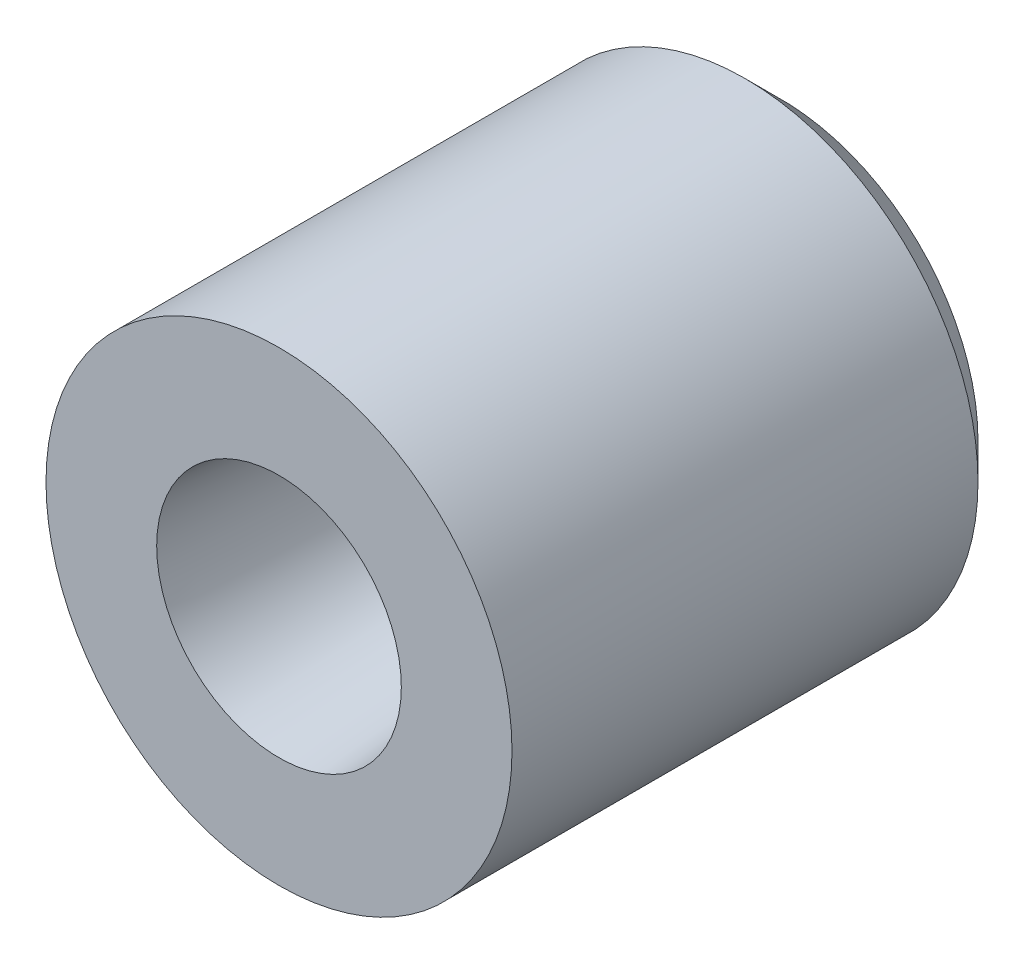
ISO-10303-21;
HEADER;
FILE_DESCRIPTION(('STEP AP214'),'2;1');
FILE_NAME('part.step','',(''),(''),'','','');
FILE_SCHEMA(('AUTOMOTIVE_DESIGN { 1 0 10303 214 1 1 1 1 }'));
ENDSEC;
DATA;
#1=APPLICATION_CONTEXT('core data for automotive mechanical design processes');
#2=APPLICATION_PROTOCOL_DEFINITION('international standard','automotive_design',2000,#1);
#3=PRODUCT_CONTEXT('',#1,'mechanical');
#4=PRODUCT('Part','Part','',(#3));
#5=PRODUCT_RELATED_PRODUCT_CATEGORY('part','',(#4));
#6=PRODUCT_DEFINITION_FORMATION('','',#4);
#7=PRODUCT_DEFINITION_CONTEXT('part definition',#1,'design');
#8=PRODUCT_DEFINITION('design','',#6,#7);
#9=PRODUCT_DEFINITION_SHAPE('','',#8);
#10=(LENGTH_UNIT() NAMED_UNIT(*) SI_UNIT(.MILLI.,.METRE.));
#11=(NAMED_UNIT(*) PLANE_ANGLE_UNIT() SI_UNIT($,.RADIAN.));
#12=(NAMED_UNIT(*) SI_UNIT($,.STERADIAN.) SOLID_ANGLE_UNIT());
#13=UNCERTAINTY_MEASURE_WITH_UNIT(LENGTH_MEASURE(1.E-05),#10,'distance_accuracy_value','');
#14=(GEOMETRIC_REPRESENTATION_CONTEXT(3) GLOBAL_UNCERTAINTY_ASSIGNED_CONTEXT((#13)) GLOBAL_UNIT_ASSIGNED_CONTEXT((#10,
#11,#12)) REPRESENTATION_CONTEXT('',''));
#15=CARTESIAN_POINT('',(0.,0.,0.));
#16=DIRECTION('',(0.,0.,1.));
#17=DIRECTION('',(1.,0.,0.));
#18=AXIS2_PLACEMENT_3D('',#15,#16,#17);
#19=CARTESIAN_POINT('',(0.,0.,-6.76768647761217));
#20=DIRECTION('',(0.,0.,1.));
#21=DIRECTION('',(1.,0.,0.));
#22=AXIS2_PLACEMENT_3D('',#19,#20,#21);
#23=CONICAL_SURFACE('',#22,4.20738154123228,0.785398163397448);
#24=CARTESIAN_POINT('',(0.,0.,-9.32506801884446));
#25=DIRECTION('',(0.,0.,1.));
#26=DIRECTION('',(1.,0.,0.));
#27=AXIS2_PLACEMENT_3D('',#24,#25,#26);
#28=CIRCLE('',#27,1.64999999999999);
#29=CARTESIAN_POINT('',(1.64999999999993,0.,-9.32506801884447));
#30=VERTEX_POINT('',#29);
#31=EDGE_CURVE('E97',#30,#30,#28,.F.);
#32=ORIENTED_EDGE('',*,*,#31,.T.);
#33=EDGE_LOOP('',(#32));
#34=FACE_BOUND('',#33,.T.);
#35=CARTESIAN_POINT('',(1.99999887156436,0.,-8.97506914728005));
#36=CARTESIAN_POINT('',(2.97506712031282,0.,-8.0000008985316));
#37=B_SPLINE_CURVE_WITH_KNOTS('',1,(#35,#36),.UNSPECIFIED.,.F.,.F.,(2,2),(0.47535476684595,
0.707106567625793),.UNSPECIFIED.);
#38=CARTESIAN_POINT('',(1.99999999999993,0.,-8.97506801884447));
#39=VERTEX_POINT('',#38);
#40=CARTESIAN_POINT('',(2.9750680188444,0.,-8.));
#41=VERTEX_POINT('',#40);
#42=EDGE_CURVE('E44',#39,#41,#37,.T.);
#43=ORIENTED_EDGE('',*,*,#42,.F.);
#44=ORIENTED_EDGE('',*,*,#42,.T.);
#45=CARTESIAN_POINT('',(0.,0.,-8.));
#46=DIRECTION('',(0.,0.,-1.));
#47=DIRECTION('',(-1.,0.,0.));
#48=AXIS2_PLACEMENT_3D('',#45,#46,#47);
#49=CIRCLE('',#48,2.97506801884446);
#50=CARTESIAN_POINT('',(-2.97506801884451,0.,-8.));
#51=VERTEX_POINT('',#50);
#52=EDGE_CURVE('E11',#51,#41,#49,.T.);
#53=ORIENTED_EDGE('',*,*,#52,.F.);
#54=CARTESIAN_POINT('',(0.,0.,-8.));
#55=DIRECTION('',(0.,0.,-1.));
#56=DIRECTION('',(-1.,0.,0.));
#57=AXIS2_PLACEMENT_3D('',#54,#55,#56);
#58=CIRCLE('',#57,2.97506801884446);
#59=EDGE_CURVE('E55',#41,#51,#58,.T.);
#60=ORIENTED_EDGE('',*,*,#59,.F.);
#61=EDGE_LOOP('',(#43,#44,#53,#60));
#62=FACE_BOUND('',#61,.T.);
#63=ADVANCED_FACE('F36',(#34,#62),#23,.F.);
#64=CARTESIAN_POINT('',(0.,0.,-7.5));
#65=DIRECTION('',(0.,0.,-1.));
#66=DIRECTION('',(-1.,0.,0.));
#67=AXIS2_PLACEMENT_3D('',#64,#65,#66);
#68=CYLINDRICAL_SURFACE('',#67,2.97506801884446);
#69=CARTESIAN_POINT('',(0.,0.,-6.));
#70=DIRECTION('',(0.,0.,-1.));
#71=DIRECTION('',(-1.,0.,0.));
#72=AXIS2_PLACEMENT_3D('',#69,#70,#71);
#73=CIRCLE('',#72,2.97506801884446);
#74=CARTESIAN_POINT('',(-2.9750680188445,0.,-6.));
#75=VERTEX_POINT('',#74);
#76=EDGE_CURVE('E145',#75,#75,#73,.T.);
#77=ORIENTED_EDGE('',*,*,#76,.F.);
#78=CARTESIAN_POINT('',(-2.9750680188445,0.,-5.99999694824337));
#79=CARTESIAN_POINT('',(-2.97506801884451,0.,-8.000002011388));
#80=B_SPLINE_CURVE_WITH_KNOTS('',1,(#78,#79),.UNSPECIFIED.,.F.,.F.,(2,2),(0.0833320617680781,
0.91666750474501),.UNSPECIFIED.);
#81=EDGE_CURVE('E140',#75,#51,#80,.T.);
#82=ORIENTED_EDGE('',*,*,#81,.T.);
#83=ORIENTED_EDGE('',*,*,#52,.T.);
#84=ORIENTED_EDGE('',*,*,#59,.T.);
#85=ORIENTED_EDGE('',*,*,#81,.F.);
#86=EDGE_LOOP('',(#77,#82,#83,#84,#85));
#87=FACE_BOUND('',#86,.T.);
#88=ADVANCED_FACE('F177',(#87),#68,.F.);
#89=CARTESIAN_POINT('',(0.,0.,-1.));
#90=DIRECTION('',(0.,0.,1.));
#91=DIRECTION('',(-1.,0.,0.));
#92=AXIS2_PLACEMENT_3D('',#89,#90,#91);
#93=CONICAL_SURFACE('',#92,3.41251133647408,0.0872664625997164);
#94=ORIENTED_EDGE('',*,*,#76,.T.);
#95=CARTESIAN_POINT('',(-2.9750680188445,0.,-6.));
#96=CARTESIAN_POINT('',(-3.41251133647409,0.,-0.999999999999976));
#97=B_SPLINE_CURVE_WITH_KNOTS('',1,(#95,#96),.UNSPECIFIED.,.F.,.F.,(2,2),(0.,1.),.UNSPECIFIED.);
#98=CARTESIAN_POINT('',(-3.41251133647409,0.,-0.999999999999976));
#99=VERTEX_POINT('',#98);
#100=EDGE_CURVE('E102',#75,#99,#97,.T.);
#101=ORIENTED_EDGE('',*,*,#100,.T.);
#102=CARTESIAN_POINT('',(0.,0.,-1.));
#103=DIRECTION('',(0.,0.,-1.));
#104=DIRECTION('',(1.,0.,0.));
#105=AXIS2_PLACEMENT_3D('',#102,#103,#104);
#106=CIRCLE('',#105,3.41251133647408);
#107=CARTESIAN_POINT('',(3.41251133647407,0.,-1.00000000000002));
#108=VERTEX_POINT('',#107);
#109=EDGE_CURVE('E127',#108,#99,#106,.T.);
#110=ORIENTED_EDGE('',*,*,#109,.F.);
#111=CARTESIAN_POINT('',(0.,0.,-1.));
#112=DIRECTION('',(0.,0.,-1.));
#113=DIRECTION('',(1.,0.,0.));
#114=AXIS2_PLACEMENT_3D('',#111,#112,#113);
#115=CIRCLE('',#114,3.41251133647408);
#116=EDGE_CURVE('E120',#99,#108,#115,.T.);
#117=ORIENTED_EDGE('',*,*,#116,.F.);
#118=ORIENTED_EDGE('',*,*,#100,.F.);
#119=EDGE_LOOP('',(#94,#101,#110,#117,#118));
#120=FACE_BOUND('',#119,.T.);
#121=ADVANCED_FACE('F175',(#120),#93,.F.);
#122=CARTESIAN_POINT('',(0.,0.,-11.3076118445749));
#123=DIRECTION('',(0.,0.,1.));
#124=DIRECTION('',(1.,0.,0.));
#125=AXIS2_PLACEMENT_3D('',#122,#123,#124);
#126=CONICAL_SURFACE('',#125,9.19238815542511,0.785398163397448);
#127=CARTESIAN_POINT('',(-1.04744440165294E-13,0.,-15.));
#128=DIRECTION('',(0.,0.,1.));
#129=DIRECTION('',(-1.,0.,0.));
#130=AXIS2_PLACEMENT_3D('',#127,#128,#129);
#131=CIRCLE('',#130,5.5);
#132=CARTESIAN_POINT('',(-5.50000000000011,0.,-15.));
#133=VERTEX_POINT('',#132);
#134=CARTESIAN_POINT('',(5.4999999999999,0.,-15.));
#135=VERTEX_POINT('',#134);
#136=EDGE_CURVE('E84',#133,#135,#131,.T.);
#137=ORIENTED_EDGE('',*,*,#136,.T.);
#138=CARTESIAN_POINT('',(5.50000026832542,0.,-14.9999997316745));
#139=CARTESIAN_POINT('',(6.50000039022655,0.,-13.9999996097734));
#140=B_SPLINE_CURVE_WITH_KNOTS('',1,(#138,#139),.UNSPECIFIED.,.F.,.F.,(2,2),(0.598321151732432,
0.707106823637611),.UNSPECIFIED.);
#141=CARTESIAN_POINT('',(6.4999999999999,0.,-14.));
#142=VERTEX_POINT('',#141);
#143=EDGE_CURVE('E89',#135,#142,#140,.T.);
#144=ORIENTED_EDGE('',*,*,#143,.T.);
#145=CARTESIAN_POINT('',(0.,0.,-14.));
#146=DIRECTION('',(0.,0.,-1.));
#147=DIRECTION('',(-1.,0.,0.));
#148=AXIS2_PLACEMENT_3D('',#145,#146,#147);
#149=CIRCLE('',#148,6.5);
#150=CARTESIAN_POINT('',(-6.5000000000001,0.,-14.));
#151=VERTEX_POINT('',#150);
#152=EDGE_CURVE('E96',#142,#151,#149,.T.);
#153=ORIENTED_EDGE('',*,*,#152,.T.);
#154=CARTESIAN_POINT('',(0.,0.,-14.));
#155=DIRECTION('',(0.,0.,-1.));
#156=DIRECTION('',(-1.,0.,0.));
#157=AXIS2_PLACEMENT_3D('',#154,#155,#156);
#158=CIRCLE('',#157,6.5);
#159=EDGE_CURVE('E99',#151,#142,#158,.T.);
#160=ORIENTED_EDGE('',*,*,#159,.T.);
#161=ORIENTED_EDGE('',*,*,#143,.F.);
#162=CARTESIAN_POINT('',(-1.04744440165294E-13,0.,-15.));
#163=DIRECTION('',(0.,0.,1.));
#164=DIRECTION('',(-1.,0.,0.));
#165=AXIS2_PLACEMENT_3D('',#162,#163,#164);
#166=CIRCLE('',#165,5.5);
#167=EDGE_CURVE('E91',#135,#133,#166,.T.);
#168=ORIENTED_EDGE('',*,*,#167,.T.);
#169=EDGE_LOOP('',(#137,#144,#153,#160,#161,#168));
#170=FACE_BOUND('',#169,.T.);
#171=ADVANCED_FACE('F86',(#170),#126,.T.);
#172=CARTESIAN_POINT('',(0.,0.,-8.));
#173=DIRECTION('',(0.,0.,-1.));
#174=DIRECTION('',(-1.,0.,0.));
#175=AXIS2_PLACEMENT_3D('',#172,#173,#174);
#176=CYLINDRICAL_SURFACE('',#175,6.5);
#177=CARTESIAN_POINT('',(0.,0.,-1.));
#178=DIRECTION('',(0.,0.,1.));
#179=DIRECTION('',(-1.,0.,0.));
#180=AXIS2_PLACEMENT_3D('',#177,#178,#179);
#181=CIRCLE('',#180,6.5);
#182=CARTESIAN_POINT('',(-6.5,0.,-0.999999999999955));
#183=VERTEX_POINT('',#182);
#184=EDGE_CURVE('E93',#183,#183,#181,.T.);
#185=ORIENTED_EDGE('',*,*,#184,.F.);
#186=CARTESIAN_POINT('',(-6.5,0.,-1.00000099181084));
#187=CARTESIAN_POINT('',(-6.5000000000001,0.,-14.0000013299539));
#188=B_SPLINE_CURVE_WITH_KNOTS('',1,(#186,#187),.UNSPECIFIED.,.F.,.F.,(2,2),(0.0833333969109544,
0.916666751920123),.UNSPECIFIED.);
#189=EDGE_CURVE('E162',#183,#151,#188,.T.);
#190=ORIENTED_EDGE('',*,*,#189,.T.);
#191=ORIENTED_EDGE('',*,*,#152,.F.);
#192=ORIENTED_EDGE('',*,*,#159,.F.);
#193=ORIENTED_EDGE('',*,*,#189,.F.);
#194=EDGE_LOOP('',(#185,#190,#191,#192,#193));
#195=FACE_BOUND('',#194,.T.);
#196=ADVANCED_FACE('F193',(#195),#176,.T.);
#197=CARTESIAN_POINT('',(12.65,-11.4315353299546,-15.));
#198=DIRECTION('',(0.,0.,-1.));
#199=DIRECTION('',(-1.,0.,0.));
#200=AXIS2_PLACEMENT_3D('',#197,#198,#199);
#201=PLANE('',#200);
#202=CARTESIAN_POINT('',(-1.04744440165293E-13,0.,-14.9999999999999));
#203=DIRECTION('',(0.,0.,-1.));
#204=DIRECTION('',(-1.,0.,0.));
#205=AXIS2_PLACEMENT_3D('',#202,#203,#204);
#206=CIRCLE('',#205,1.64999999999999);
#207=CARTESIAN_POINT('',(-1.65000000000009,0.,-14.9999999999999));
#208=VERTEX_POINT('',#207);
#209=EDGE_CURVE('E186',#208,#208,#206,.T.);
#210=ORIENTED_EDGE('',*,*,#209,.F.);
#211=EDGE_LOOP('',(#210));
#212=FACE_BOUND('',#211,.T.);
#213=ORIENTED_EDGE('',*,*,#167,.F.);
#214=ORIENTED_EDGE('',*,*,#136,.F.);
#215=EDGE_LOOP('',(#213,#214));
#216=FACE_BOUND('',#215,.T.);
#217=ADVANCED_FACE('F95',(#212,#216),#201,.T.);
#218=CARTESIAN_POINT('',(-8.45,-13.5099962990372,-0.999999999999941));
#219=DIRECTION('',(0.,0.,1.));
#220=DIRECTION('',(1.,0.,0.));
#221=AXIS2_PLACEMENT_3D('',#218,#219,#220);
#222=PLANE('',#221);
#223=ORIENTED_EDGE('',*,*,#184,.T.);
#224=EDGE_LOOP('',(#223));
#225=FACE_BOUND('',#224,.T.);
#226=ORIENTED_EDGE('',*,*,#109,.T.);
#227=ORIENTED_EDGE('',*,*,#116,.T.);
#228=EDGE_LOOP('',(#226,#227));
#229=FACE_BOUND('',#228,.T.);
#230=ADVANCED_FACE('F195',(#225,#229),#222,.T.);
#231=CARTESIAN_POINT('',(-1.04744440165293E-13,0.,-14.9999999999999));
#232=DIRECTION('',(0.,0.,-1.));
#233=DIRECTION('',(-1.,0.,0.));
#234=AXIS2_PLACEMENT_3D('',#231,#232,#233);
#235=CYLINDRICAL_SURFACE('',#234,1.64999999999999);
#236=ORIENTED_EDGE('',*,*,#209,.T.);
#237=EDGE_LOOP('',(#236));
#238=FACE_BOUND('',#237,.T.);
#239=ORIENTED_EDGE('',*,*,#31,.F.);
#240=EDGE_LOOP('',(#239));
#241=FACE_BOUND('',#240,.T.);
#242=ADVANCED_FACE('F198',(#238,#241),#235,.F.);
#243=CLOSED_SHELL('',(#63,#88,#121,#171,#196,#217,#230,#242));
#244=MANIFOLD_SOLID_BREP('B2',#243);
#245=ADVANCED_BREP_SHAPE_REPRESENTATION('',(#18,#244),#14);
#246=SHAPE_DEFINITION_REPRESENTATION(#9,#245);
ENDSEC;
END-ISO-10303-21;
